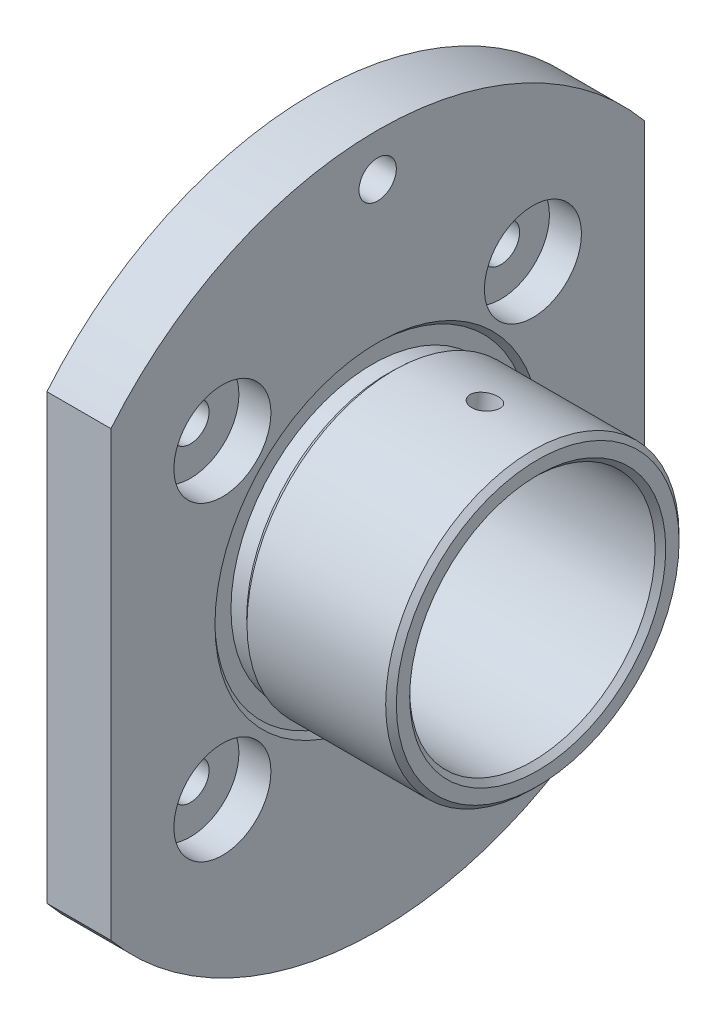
ISO-10303-21;
HEADER;
FILE_DESCRIPTION(('STEP AP214'),'2;1');
FILE_NAME('part.step','',(''),(''),'','','');
FILE_SCHEMA(('AUTOMOTIVE_DESIGN { 1 0 10303 214 1 1 1 1 }'));
ENDSEC;
DATA;
#1=APPLICATION_CONTEXT('core data for automotive mechanical design processes');
#2=APPLICATION_PROTOCOL_DEFINITION('international standard','automotive_design',2000,#1);
#3=PRODUCT_CONTEXT('',#1,'mechanical');
#4=PRODUCT('Part','Part','',(#3));
#5=PRODUCT_RELATED_PRODUCT_CATEGORY('part','',(#4));
#6=PRODUCT_DEFINITION_FORMATION('','',#4);
#7=PRODUCT_DEFINITION_CONTEXT('part definition',#1,'design');
#8=PRODUCT_DEFINITION('design','',#6,#7);
#9=PRODUCT_DEFINITION_SHAPE('','',#8);
#10=(LENGTH_UNIT() NAMED_UNIT(*) SI_UNIT(.MILLI.,.METRE.));
#11=(NAMED_UNIT(*) PLANE_ANGLE_UNIT() SI_UNIT($,.RADIAN.));
#12=(NAMED_UNIT(*) SI_UNIT($,.STERADIAN.) SOLID_ANGLE_UNIT());
#13=UNCERTAINTY_MEASURE_WITH_UNIT(LENGTH_MEASURE(1.E-05),#10,'distance_accuracy_value','');
#14=(GEOMETRIC_REPRESENTATION_CONTEXT(3) GLOBAL_UNCERTAINTY_ASSIGNED_CONTEXT((#13)) GLOBAL_UNIT_ASSIGNED_CONTEXT((#10,
#11,#12)) REPRESENTATION_CONTEXT('',''));
#15=CARTESIAN_POINT('',(0.,0.,0.));
#16=DIRECTION('',(0.,0.,1.));
#17=DIRECTION('',(1.,0.,0.));
#18=AXIS2_PLACEMENT_3D('',#15,#16,#17);
#19=CARTESIAN_POINT('',(-67.2248501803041,0.,0.));
#20=DIRECTION('',(-1.,0.,0.));
#21=DIRECTION('',(0.,0.,1.));
#22=AXIS2_PLACEMENT_3D('',#19,#20,#21);
#23=CYLINDRICAL_SURFACE('',#22,65.);
#24=CARTESIAN_POINT('',(-39.7519478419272,0.,0.));
#25=DIRECTION('',(-1.,0.,0.));
#26=DIRECTION('',(0.,0.,1.));
#27=AXIS2_PLACEMENT_3D('',#24,#25,#26);
#28=CIRCLE('',#27,65.);
#29=CARTESIAN_POINT('',(-39.7519478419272,41.5331193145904,50.));
#30=VERTEX_POINT('',#29);
#31=CARTESIAN_POINT('',(-39.7519478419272,41.5331193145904,-50.));
#32=VERTEX_POINT('',#31);
#33=EDGE_CURVE('E83',#30,#32,#28,.T.);
#34=ORIENTED_EDGE('',*,*,#33,.T.);
#35=DIRECTION('',(-1.,0.,0.));
#36=VECTOR('',#35,1.);
#37=CARTESIAN_POINT('',(-67.2248501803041,41.5331193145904,-50.));
#38=LINE('',#37,#36);
#39=CARTESIAN_POINT('',(-51.7519478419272,41.5331193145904,-50.));
#40=VERTEX_POINT('',#39);
#41=EDGE_CURVE('E73',#32,#40,#38,.T.);
#42=ORIENTED_EDGE('',*,*,#41,.T.);
#43=CARTESIAN_POINT('',(-51.7519478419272,0.,0.));
#44=DIRECTION('',(-1.,0.,0.));
#45=DIRECTION('',(0.,0.,1.));
#46=AXIS2_PLACEMENT_3D('',#43,#44,#45);
#47=CIRCLE('',#46,65.);
#48=CARTESIAN_POINT('',(-51.7519478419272,41.5331193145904,50.));
#49=VERTEX_POINT('',#48);
#50=EDGE_CURVE('E81',#49,#40,#47,.T.);
#51=ORIENTED_EDGE('',*,*,#50,.F.);
#52=DIRECTION('',(-1.,0.,0.));
#53=VECTOR('',#52,1.);
#54=CARTESIAN_POINT('',(-67.2248501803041,41.5331193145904,50.));
#55=LINE('',#54,#53);
#56=EDGE_CURVE('E55',#49,#30,#55,.F.);
#57=ORIENTED_EDGE('',*,*,#56,.T.);
#58=EDGE_LOOP('',(#34,#42,#51,#57));
#59=FACE_BOUND('',#58,.T.);
#60=ADVANCED_FACE('F33',(#59),#23,.T.);
#61=CARTESIAN_POINT('',(-59.7519478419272,-29.1036255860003,29.1036255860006));
#62=DIRECTION('',(1.,0.,0.));
#63=DIRECTION('',(0.,0.,-1.));
#64=AXIS2_PLACEMENT_3D('',#61,#62,#63);
#65=CYLINDRICAL_SURFACE('',#64,3.49999999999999);
#66=CARTESIAN_POINT('',(-51.7519478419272,-29.1036255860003,29.1036255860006));
#67=DIRECTION('',(1.,0.,0.));
#68=DIRECTION('',(0.,0.,-1.));
#69=AXIS2_PLACEMENT_3D('',#66,#67,#68);
#70=CIRCLE('',#69,3.49999999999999);
#71=CARTESIAN_POINT('',(-51.7519478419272,-29.1036255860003,25.6036255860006));
#72=VERTEX_POINT('',#71);
#73=EDGE_CURVE('E234',#72,#72,#70,.T.);
#74=ORIENTED_EDGE('',*,*,#73,.F.);
#75=EDGE_LOOP('',(#74));
#76=FACE_BOUND('',#75,.T.);
#77=CARTESIAN_POINT('',(-45.7519478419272,-29.1036255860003,29.1036255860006));
#78=DIRECTION('',(1.,0.,0.));
#79=DIRECTION('',(0.,0.,-1.));
#80=AXIS2_PLACEMENT_3D('',#77,#78,#79);
#81=CIRCLE('',#80,3.49999999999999);
#82=CARTESIAN_POINT('',(-45.7519478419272,-29.1036255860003,25.6036255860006));
#83=VERTEX_POINT('',#82);
#84=EDGE_CURVE('E216',#83,#83,#81,.F.);
#85=ORIENTED_EDGE('',*,*,#84,.F.);
#86=EDGE_LOOP('',(#85));
#87=FACE_BOUND('',#86,.T.);
#88=ADVANCED_FACE('F190',(#76,#87),#65,.F.);
#89=CARTESIAN_POINT('',(-59.7519478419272,-29.1036255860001,-29.1036255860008));
#90=DIRECTION('',(1.,0.,0.));
#91=DIRECTION('',(0.,0.,-1.));
#92=AXIS2_PLACEMENT_3D('',#89,#90,#91);
#93=CYLINDRICAL_SURFACE('',#92,3.5);
#94=CARTESIAN_POINT('',(-51.7519478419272,-29.1036255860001,-29.1036255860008));
#95=DIRECTION('',(1.,0.,0.));
#96=DIRECTION('',(0.,0.,-1.));
#97=AXIS2_PLACEMENT_3D('',#94,#95,#96);
#98=CIRCLE('',#97,3.5);
#99=CARTESIAN_POINT('',(-51.7519478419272,-29.1036255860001,-32.6036255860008));
#100=VERTEX_POINT('',#99);
#101=EDGE_CURVE('E238',#100,#100,#98,.T.);
#102=ORIENTED_EDGE('',*,*,#101,.F.);
#103=EDGE_LOOP('',(#102));
#104=FACE_BOUND('',#103,.T.);
#105=CARTESIAN_POINT('',(-45.7519478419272,-29.1036255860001,-29.1036255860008));
#106=DIRECTION('',(1.,0.,0.));
#107=DIRECTION('',(0.,0.,-1.));
#108=AXIS2_PLACEMENT_3D('',#105,#106,#107);
#109=CIRCLE('',#108,3.5);
#110=CARTESIAN_POINT('',(-45.7519478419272,-29.1036255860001,-32.6036255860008));
#111=VERTEX_POINT('',#110);
#112=EDGE_CURVE('E221',#111,#111,#109,.F.);
#113=ORIENTED_EDGE('',*,*,#112,.F.);
#114=EDGE_LOOP('',(#113));
#115=FACE_BOUND('',#114,.T.);
#116=ADVANCED_FACE('F195',(#104,#115),#93,.F.);
#117=CARTESIAN_POINT('',(-59.7519478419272,29.1036255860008,-29.1036255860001));
#118=DIRECTION('',(1.,0.,0.));
#119=DIRECTION('',(0.,0.,-1.));
#120=AXIS2_PLACEMENT_3D('',#117,#118,#119);
#121=CYLINDRICAL_SURFACE('',#120,3.5);
#122=CARTESIAN_POINT('',(-51.7519478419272,29.1036255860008,-29.1036255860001));
#123=DIRECTION('',(1.,0.,0.));
#124=DIRECTION('',(0.,0.,-1.));
#125=AXIS2_PLACEMENT_3D('',#122,#123,#124);
#126=CIRCLE('',#125,3.5);
#127=CARTESIAN_POINT('',(-51.7519478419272,29.1036255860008,-32.6036255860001));
#128=VERTEX_POINT('',#127);
#129=EDGE_CURVE('E241',#128,#128,#126,.T.);
#130=ORIENTED_EDGE('',*,*,#129,.F.);
#131=EDGE_LOOP('',(#130));
#132=FACE_BOUND('',#131,.T.);
#133=CARTESIAN_POINT('',(-45.7519478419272,29.1036255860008,-29.1036255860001));
#134=DIRECTION('',(1.,0.,0.));
#135=DIRECTION('',(0.,0.,-1.));
#136=AXIS2_PLACEMENT_3D('',#133,#134,#135);
#137=CIRCLE('',#136,3.5);
#138=CARTESIAN_POINT('',(-45.7519478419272,29.1036255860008,-32.6036255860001));
#139=VERTEX_POINT('',#138);
#140=EDGE_CURVE('E226',#139,#139,#137,.F.);
#141=ORIENTED_EDGE('',*,*,#140,.F.);
#142=EDGE_LOOP('',(#141));
#143=FACE_BOUND('',#142,.T.);
#144=ADVANCED_FACE('F277',(#132,#143),#121,.F.);
#145=CARTESIAN_POINT('',(-59.7519478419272,29.1036255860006,29.1036255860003));
#146=DIRECTION('',(1.,0.,0.));
#147=DIRECTION('',(0.,0.,-1.));
#148=AXIS2_PLACEMENT_3D('',#145,#146,#147);
#149=CYLINDRICAL_SURFACE('',#148,3.5);
#150=CARTESIAN_POINT('',(-51.7519478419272,29.1036255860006,29.1036255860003));
#151=DIRECTION('',(1.,0.,0.));
#152=DIRECTION('',(0.,0.,-1.));
#153=AXIS2_PLACEMENT_3D('',#150,#151,#152);
#154=CIRCLE('',#153,3.5);
#155=CARTESIAN_POINT('',(-51.7519478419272,29.1036255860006,25.6036255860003));
#156=VERTEX_POINT('',#155);
#157=EDGE_CURVE('E243',#156,#156,#154,.T.);
#158=ORIENTED_EDGE('',*,*,#157,.F.);
#159=EDGE_LOOP('',(#158));
#160=FACE_BOUND('',#159,.T.);
#161=CARTESIAN_POINT('',(-45.7519478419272,29.1036255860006,29.1036255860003));
#162=DIRECTION('',(1.,0.,0.));
#163=DIRECTION('',(0.,0.,-1.));
#164=AXIS2_PLACEMENT_3D('',#161,#162,#163);
#165=CIRCLE('',#164,3.5);
#166=CARTESIAN_POINT('',(-45.7519478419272,29.1036255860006,25.6036255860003));
#167=VERTEX_POINT('',#166);
#168=EDGE_CURVE('E231',#167,#167,#165,.F.);
#169=ORIENTED_EDGE('',*,*,#168,.F.);
#170=EDGE_LOOP('',(#169));
#171=FACE_BOUND('',#170,.T.);
#172=ADVANCED_FACE('F175',(#160,#171),#149,.F.);
#173=CARTESIAN_POINT('',(-67.2248501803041,0.,0.));
#174=DIRECTION('',(-1.,0.,0.));
#175=DIRECTION('',(0.,0.,1.));
#176=AXIS2_PLACEMENT_3D('',#173,#174,#175);
#177=CYLINDRICAL_SURFACE('',#176,35.);
#178=CARTESIAN_POINT('',(-54.7519478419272,0.,0.));
#179=DIRECTION('',(-1.,0.,0.));
#180=DIRECTION('',(0.,0.,1.));
#181=AXIS2_PLACEMENT_3D('',#178,#179,#180);
#182=CIRCLE('',#181,35.);
#183=CARTESIAN_POINT('',(-54.7519478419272,0.,35.));
#184=VERTEX_POINT('',#183);
#185=EDGE_CURVE('E110',#184,#184,#182,.T.);
#186=ORIENTED_EDGE('',*,*,#185,.F.);
#187=EDGE_LOOP('',(#186));
#188=FACE_BOUND('',#187,.T.);
#189=CARTESIAN_POINT('',(-51.7519478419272,0.,0.));
#190=DIRECTION('',(-1.,0.,0.));
#191=DIRECTION('',(0.,0.,1.));
#192=AXIS2_PLACEMENT_3D('',#189,#190,#191);
#193=CIRCLE('',#192,35.);
#194=CARTESIAN_POINT('',(-51.7519478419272,0.,35.));
#195=VERTEX_POINT('',#194);
#196=EDGE_CURVE('E91',#195,#195,#193,.T.);
#197=ORIENTED_EDGE('',*,*,#196,.T.);
#198=EDGE_LOOP('',(#197));
#199=FACE_BOUND('',#198,.T.);
#200=ADVANCED_FACE('F171',(#188,#199),#177,.T.);
#201=CARTESIAN_POINT('',(-54.7519478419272,23.,0.));
#202=DIRECTION('',(1.,0.,0.));
#203=DIRECTION('',(0.,0.,-1.));
#204=AXIS2_PLACEMENT_3D('',#201,#202,#203);
#205=PLANE('',#204);
#206=CARTESIAN_POINT('',(-54.7519478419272,0.,0.));
#207=DIRECTION('',(1.,0.,0.));
#208=DIRECTION('',(0.,0.,-1.));
#209=AXIS2_PLACEMENT_3D('',#206,#207,#208);
#210=CIRCLE('',#209,24.);
#211=CARTESIAN_POINT('',(-54.7519478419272,0.,-24.));
#212=VERTEX_POINT('',#211);
#213=EDGE_CURVE('E119',#212,#212,#210,.T.);
#214=ORIENTED_EDGE('',*,*,#213,.T.);
#215=EDGE_LOOP('',(#214));
#216=FACE_BOUND('',#215,.T.);
#217=ORIENTED_EDGE('',*,*,#185,.T.);
#218=EDGE_LOOP('',(#217));
#219=FACE_BOUND('',#218,.T.);
#220=ADVANCED_FACE('F167',(#216,#219),#205,.F.);
#221=CARTESIAN_POINT('',(-67.2248501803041,0.,0.));
#222=DIRECTION('',(-1.,0.,0.));
#223=DIRECTION('',(0.,0.,1.));
#224=AXIS2_PLACEMENT_3D('',#221,#222,#223);
#225=CYLINDRICAL_SURFACE('',#224,23.);
#226=CARTESIAN_POINT('',(-23.4046931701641,22.9904768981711,-0.661794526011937));
#227=CARTESIAN_POINT('',(-23.2647128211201,22.9904778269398,-0.661800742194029));
#228=CARTESIAN_POINT('',(-23.1246415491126,22.990144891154,-0.673657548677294));
#229=CARTESIAN_POINT('',(-22.8483872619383,22.9887154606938,-0.720760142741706));
#230=CARTESIAN_POINT('',(-22.7122086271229,22.9876181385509,-0.756031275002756));
#231=CARTESIAN_POINT('',(-22.4477799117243,22.9843763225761,-0.848875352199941));
#232=CARTESIAN_POINT('',(-22.3195248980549,22.9822324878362,-0.906434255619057));
#233=CARTESIAN_POINT('',(-22.0744801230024,22.9764785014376,-1.04212526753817));
#234=CARTESIAN_POINT('',(-21.9576881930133,22.9728686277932,-1.12025347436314));
#235=CARTESIAN_POINT('',(-21.7383598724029,22.9636731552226,-1.29514068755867));
#236=CARTESIAN_POINT('',(-21.6358793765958,22.9580800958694,-1.39196940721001));
#237=CARTESIAN_POINT('',(-21.4485648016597,22.9444310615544,-1.60126787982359));
#238=CARTESIAN_POINT('',(-21.3637315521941,22.9363749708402,-1.71373836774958));
#239=CARTESIAN_POINT('',(-21.2139236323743,22.9173801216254,-1.9513869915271));
#240=CARTESIAN_POINT('',(-21.1489988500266,22.9064342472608,-2.07659602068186));
#241=CARTESIAN_POINT('',(-21.0411701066,22.8814474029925,-2.33587426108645));
#242=CARTESIAN_POINT('',(-20.9982655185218,22.867406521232,-2.4699432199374));
#243=CARTESIAN_POINT('',(-20.9358601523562,22.8363158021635,-2.74251936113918));
#244=CARTESIAN_POINT('',(-20.9162671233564,22.8192781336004,-2.88100680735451));
#245=CARTESIAN_POINT('',(-20.9007554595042,22.7824659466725,-3.15893829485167));
#246=CARTESIAN_POINT('',(-20.9048361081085,22.7626915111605,-3.29838230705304));
#247=CARTESIAN_POINT('',(-20.9364813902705,22.7210980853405,-3.57365408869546));
#248=CARTESIAN_POINT('',(-20.9639468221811,22.6992880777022,-3.70949463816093));
#249=CARTESIAN_POINT('',(-21.0414273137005,22.6544139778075,-3.97436571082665));
#250=CARTESIAN_POINT('',(-21.0914427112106,22.6313498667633,-4.10339613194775));
#251=CARTESIAN_POINT('',(-21.2127110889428,22.584988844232,-4.35134890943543));
#252=CARTESIAN_POINT('',(-21.2840076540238,22.5616915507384,-4.47024987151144));
#253=CARTESIAN_POINT('',(-21.4457828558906,22.5161174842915,-4.69441774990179));
#254=CARTESIAN_POINT('',(-21.5362621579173,22.4938407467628,-4.79968419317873));
#255=CARTESIAN_POINT('',(-21.7343916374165,22.4514461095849,-4.99425219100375));
#256=CARTESIAN_POINT('',(-21.8421281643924,22.4313399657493,-5.08346839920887));
#257=CARTESIAN_POINT('',(-22.071415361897,22.3946283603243,-5.24283605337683));
#258=CARTESIAN_POINT('',(-22.1929660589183,22.3780229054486,-5.31298746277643));
#259=CARTESIAN_POINT('',(-22.4465008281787,22.349356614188,-5.43231482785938));
#260=CARTESIAN_POINT('',(-22.5784877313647,22.3372970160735,-5.48148506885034));
#261=CARTESIAN_POINT('',(-22.8491132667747,22.3185201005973,-5.55744593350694));
#262=CARTESIAN_POINT('',(-22.9877516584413,22.3118025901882,-5.58423736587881));
#263=CARTESIAN_POINT('',(-23.266986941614,22.3041800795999,-5.61460589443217));
#264=CARTESIAN_POINT('',(-23.4075702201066,22.3032455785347,-5.6183008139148));
#265=CARTESIAN_POINT('',(-23.687369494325,22.3071730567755,-5.60268618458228));
#266=CARTESIAN_POINT('',(-23.826585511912,22.3120349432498,-5.58337700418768));
#267=CARTESIAN_POINT('',(-24.0993432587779,22.3272107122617,-5.52237589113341));
#268=CARTESIAN_POINT('',(-24.2328983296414,22.3375109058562,-5.48074015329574));
#269=CARTESIAN_POINT('',(-24.4909586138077,22.3628834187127,-5.37627358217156));
#270=CARTESIAN_POINT('',(-24.6154635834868,22.3779558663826,-5.31344217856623));
#271=CARTESIAN_POINT('',(-24.85243853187,22.4119910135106,-5.16800134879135));
#272=CARTESIAN_POINT('',(-24.9648581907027,22.4309690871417,-5.08531353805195));
#273=CARTESIAN_POINT('',(-25.1739600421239,22.4716249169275,-4.90253166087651));
#274=CARTESIAN_POINT('',(-25.270641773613,22.4933027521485,-4.802437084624));
#275=CARTESIAN_POINT('',(-25.4459422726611,22.5382083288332,-4.5870788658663));
#276=CARTESIAN_POINT('',(-25.5244820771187,22.5614422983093,-4.47175222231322));
#277=CARTESIAN_POINT('',(-25.6607249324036,22.60812204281,-4.22942340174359));
#278=CARTESIAN_POINT('',(-25.718428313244,22.631567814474,-4.10242140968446));
#279=CARTESIAN_POINT('',(-25.8112276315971,22.6774737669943,-3.84054724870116));
#280=CARTESIAN_POINT('',(-25.8463705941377,22.6999359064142,-3.70569209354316));
#281=CARTESIAN_POINT('',(-25.8932048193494,22.7429727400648,-3.43167813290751));
#282=CARTESIAN_POINT('',(-25.9048968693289,22.7635474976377,-3.29251947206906));
#283=CARTESIAN_POINT('',(-25.9044851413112,22.8020122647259,-3.01460063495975));
#284=CARTESIAN_POINT('',(-25.8925036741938,22.8199155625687,-2.87584210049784));
#285=CARTESIAN_POINT('',(-25.8453423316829,22.8527634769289,-2.60196670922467));
#286=CARTESIAN_POINT('',(-25.8101624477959,22.867708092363,-2.46684985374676));
#287=CARTESIAN_POINT('',(-25.7176382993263,22.8945234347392,-2.20414208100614));
#288=CARTESIAN_POINT('',(-25.6602983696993,22.9063947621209,-2.0765496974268));
#289=CARTESIAN_POINT('',(-25.5250946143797,22.9272109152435,-1.83248990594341));
#290=CARTESIAN_POINT('',(-25.447230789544,22.9361557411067,-1.7160224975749));
#291=CARTESIAN_POINT('',(-25.2727324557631,22.9514967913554,-1.49697385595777));
#292=CARTESIAN_POINT('',(-25.1760068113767,22.9578801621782,-1.39446432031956));
#293=CARTESIAN_POINT('',(-24.966714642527,22.9685027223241,-1.20694974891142));
#294=CARTESIAN_POINT('',(-24.8541443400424,22.9727413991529,-1.12194889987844));
#295=CARTESIAN_POINT('',(-24.6159868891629,22.9795865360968,-0.971745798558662));
#296=CARTESIAN_POINT('',(-24.4903622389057,22.9821881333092,-0.90660282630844));
#297=CARTESIAN_POINT('',(-24.2300085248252,22.9862003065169,-0.798467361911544));
#298=CARTESIAN_POINT('',(-24.0952898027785,22.9876122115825,-0.755450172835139));
#299=CARTESIAN_POINT('',(-23.8673060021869,22.9892493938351,-0.703431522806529));
#300=CARTESIAN_POINT('',(-23.7754926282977,22.9897147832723,-0.687840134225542));
#301=CARTESIAN_POINT('',(-23.5906972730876,22.9903282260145,-0.667019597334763));
#302=CARTESIAN_POINT('',(-23.4977152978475,22.9904762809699,-0.661790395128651));
#303=CARTESIAN_POINT('',(-23.4046931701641,22.9904768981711,-0.661794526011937));
#304=B_SPLINE_CURVE_WITH_KNOTS('',3,(#226,#227,#228,#229,#230,#231,#232,#233,#234,#235,#236,
#237,#238,#239,#240,#241,#242,#243,#244,#245,#246,#247,#248,#249,#250,#251,#252,#253,#254,#255,
#256,#257,#258,#259,#260,#261,#262,#263,#264,#265,#266,#267,#268,#269,#270,#271,#272,#273,#274,
#275,#276,#277,#278,#279,#280,#281,#282,#283,#284,#285,#286,#287,#288,#289,#290,#291,#292,#293,
#294,#295,#296,#297,#298,#299,#300,#301,#302,#303),.UNSPECIFIED.,.T.,.F.,(4,2,2,2,2,2,2,2,2,2,2,
2,2,2,2,2,2,2,2,2,2,2,2,2,2,2,2,2,2,2,2,2,2,2,2,2,2,2,4),(0.,0.419601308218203,
0.839657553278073,1.25944958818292,1.67916205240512,2.10047045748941,2.5217986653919,
2.9441741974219,3.36653770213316,3.78722416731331,4.20789789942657,4.6267959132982,
5.04570020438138,5.46546838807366,5.88525113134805,6.30720400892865,6.72915769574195,
7.15122623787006,7.57327952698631,7.99317800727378,8.41306976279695,8.83190959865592,
9.2507607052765,9.67129325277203,10.0918381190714,10.5141803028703,10.9365157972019,
11.3579680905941,11.7794062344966,12.1986726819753,12.6179392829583,13.0371239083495,
13.4563085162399,13.8775710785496,14.2989342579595,14.7215432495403,15.143679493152,
15.4225215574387,15.7013621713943),.UNSPECIFIED.);
#305=CARTESIAN_POINT('',(-23.4046931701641,22.9904768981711,-0.661794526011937));
#306=VERTEX_POINT('',#305);
#307=EDGE_CURVE('E154',#306,#306,#304,.T.);
#308=ORIENTED_EDGE('',*,*,#307,.T.);
#309=EDGE_LOOP('',(#308));
#310=FACE_BOUND('',#309,.T.);
#311=CARTESIAN_POINT('',(-53.7519478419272,0.,0.));
#312=DIRECTION('',(1.,0.,0.));
#313=DIRECTION('',(0.,0.,-1.));
#314=AXIS2_PLACEMENT_3D('',#311,#312,#313);
#315=CIRCLE('',#314,23.);
#316=CARTESIAN_POINT('',(-53.7519478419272,0.,-23.));
#317=VERTEX_POINT('',#316);
#318=EDGE_CURVE('E116',#317,#317,#315,.F.);
#319=ORIENTED_EDGE('',*,*,#318,.T.);
#320=EDGE_LOOP('',(#319));
#321=FACE_BOUND('',#320,.T.);
#322=CARTESIAN_POINT('',(-10.7519478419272,0.,0.));
#323=DIRECTION('',(-1.,0.,0.));
#324=DIRECTION('',(0.,0.,1.));
#325=AXIS2_PLACEMENT_3D('',#322,#323,#324);
#326=CIRCLE('',#325,23.);
#327=CARTESIAN_POINT('',(-10.7519478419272,0.,23.));
#328=VERTEX_POINT('',#327);
#329=EDGE_CURVE('E113',#328,#328,#326,.F.);
#330=ORIENTED_EDGE('',*,*,#329,.T.);
#331=EDGE_LOOP('',(#330));
#332=FACE_BOUND('',#331,.T.);
#333=ADVANCED_FACE('F162',(#310,#321,#332),#225,.F.);
#334=CARTESIAN_POINT('',(-9.75194784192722,27.5,0.));
#335=DIRECTION('',(-1.,0.,0.));
#336=DIRECTION('',(0.,0.,1.));
#337=AXIS2_PLACEMENT_3D('',#334,#335,#336);
#338=PLANE('',#337);
#339=CARTESIAN_POINT('',(-9.75194784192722,0.,0.));
#340=DIRECTION('',(-1.,0.,0.));
#341=DIRECTION('',(0.,0.,1.));
#342=AXIS2_PLACEMENT_3D('',#339,#340,#341);
#343=CIRCLE('',#342,24.);
#344=CARTESIAN_POINT('',(-9.75194784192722,0.,24.));
#345=VERTEX_POINT('',#344);
#346=EDGE_CURVE('E125',#345,#345,#343,.T.);
#347=ORIENTED_EDGE('',*,*,#346,.T.);
#348=EDGE_LOOP('',(#347));
#349=FACE_BOUND('',#348,.T.);
#350=CARTESIAN_POINT('',(-9.75194784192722,0.,0.));
#351=DIRECTION('',(-1.,0.,0.));
#352=DIRECTION('',(0.,0.,1.));
#353=AXIS2_PLACEMENT_3D('',#350,#351,#352);
#354=CIRCLE('',#353,26.5);
#355=CARTESIAN_POINT('',(-9.75194784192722,0.,26.5));
#356=VERTEX_POINT('',#355);
#357=EDGE_CURVE('E122',#356,#356,#354,.F.);
#358=ORIENTED_EDGE('',*,*,#357,.T.);
#359=EDGE_LOOP('',(#358));
#360=FACE_BOUND('',#359,.T.);
#361=ADVANCED_FACE('F166',(#349,#360),#338,.F.);
#362=CARTESIAN_POINT('',(-67.2248501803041,0.,0.));
#363=DIRECTION('',(-1.,0.,0.));
#364=DIRECTION('',(0.,0.,1.));
#365=AXIS2_PLACEMENT_3D('',#362,#363,#364);
#366=CYLINDRICAL_SURFACE('',#365,27.5);
#367=CARTESIAN_POINT('',(-23.4046931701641,27.4700776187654,-1.28251144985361));
#368=CARTESIAN_POINT('',(-23.5448076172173,27.4700782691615,-1.28251769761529));
#369=CARTESIAN_POINT('',(-23.685016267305,27.4695320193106,-1.29436765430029));
#370=CARTESIAN_POINT('',(-23.9615507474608,27.4672722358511,-1.34145069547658));
#371=CARTESIAN_POINT('',(-24.0978720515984,27.4655573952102,-1.37670996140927));
#372=CARTESIAN_POINT('',(-24.3625868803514,27.4607463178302,-1.4695437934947));
#373=CARTESIAN_POINT('',(-24.4909849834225,27.4576508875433,-1.52710532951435));
#374=CARTESIAN_POINT('',(-24.7362878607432,27.4497649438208,-1.66282989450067));
#375=CARTESIAN_POINT('',(-24.8531950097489,27.4449747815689,-1.74098865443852));
#376=CARTESIAN_POINT('',(-25.072580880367,27.4333210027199,-1.91587499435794));
#377=CARTESIAN_POINT('',(-25.1750199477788,27.4264518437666,-2.01265195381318));
#378=CARTESIAN_POINT('',(-25.3622207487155,27.4102970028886,-2.22184635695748));
#379=CARTESIAN_POINT('',(-25.4469816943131,27.4010112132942,-2.33426449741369));
#380=CARTESIAN_POINT('',(-25.596554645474,27.3797458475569,-2.57171713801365));
#381=CARTESIAN_POINT('',(-25.6613319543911,27.3677616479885,-2.6967730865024));
#382=CARTESIAN_POINT('',(-25.7688769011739,27.3410047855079,-2.95573744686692));
#383=CARTESIAN_POINT('',(-25.8116449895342,27.3262321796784,-3.08964567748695));
#384=CARTESIAN_POINT('',(-25.8738422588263,27.2940506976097,-3.36207491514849));
#385=CARTESIAN_POINT('',(-25.8933360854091,27.2766492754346,-3.50058204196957));
#386=CARTESIAN_POINT('',(-25.9086313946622,27.2395288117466,-3.77858870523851));
#387=CARTESIAN_POINT('',(-25.9044333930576,27.2198098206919,-3.91808822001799));
#388=CARTESIAN_POINT('',(-25.8725169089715,27.1787108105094,-4.19369045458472));
#389=CARTESIAN_POINT('',(-25.8448679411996,27.1573358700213,-4.32980199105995));
#390=CARTESIAN_POINT('',(-25.7669425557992,27.1136853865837,-4.59523312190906));
#391=CARTESIAN_POINT('',(-25.7166658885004,27.0914098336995,-4.72455264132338));
#392=CARTESIAN_POINT('',(-25.5948353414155,27.046908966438,-4.97299537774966));
#393=CARTESIAN_POINT('',(-25.5232504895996,27.0246837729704,-5.09210342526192));
#394=CARTESIAN_POINT('',(-25.3608580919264,26.9814081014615,-5.31664484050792));
#395=CARTESIAN_POINT('',(-25.2700500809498,26.9603576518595,-5.42207787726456));
#396=CARTESIAN_POINT('',(-25.0713976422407,26.9204766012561,-5.61674907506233));
#397=CARTESIAN_POINT('',(-24.9634927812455,26.9016543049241,-5.70592727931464));
#398=CARTESIAN_POINT('',(-24.7339198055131,26.867385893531,-5.86517103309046));
#399=CARTESIAN_POINT('',(-24.6122516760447,26.8519397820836,-5.93523656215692));
#400=CARTESIAN_POINT('',(-24.3585616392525,26.8253391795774,-6.05433070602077));
#401=CARTESIAN_POINT('',(-24.2265380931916,26.8141853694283,-6.10335598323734));
#402=CARTESIAN_POINT('',(-23.9559063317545,26.7968596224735,-6.17898316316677));
#403=CARTESIAN_POINT('',(-23.817298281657,26.79068756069,-6.20558562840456));
#404=CARTESIAN_POINT('',(-23.537962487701,26.7837257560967,-6.23556535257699));
#405=CARTESIAN_POINT('',(-23.3972440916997,26.7829168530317,-6.23902529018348));
#406=CARTESIAN_POINT('',(-23.1172162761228,26.7866813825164,-6.22284234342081));
#407=CARTESIAN_POINT('',(-22.9779068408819,26.7912547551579,-6.20319971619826));
#408=CARTESIAN_POINT('',(-22.7048956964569,26.8054843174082,-6.1414169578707));
#409=CARTESIAN_POINT('',(-22.5711847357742,26.8151317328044,-6.09931566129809));
#410=CARTESIAN_POINT('',(-22.3128790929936,26.8389118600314,-5.99380660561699));
#411=CARTESIAN_POINT('',(-22.1882845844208,26.8530446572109,-5.93039844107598));
#412=CARTESIAN_POINT('',(-21.9513624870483,26.8849997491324,-5.78380589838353));
#413=CARTESIAN_POINT('',(-21.8390705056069,26.9028323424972,-5.70056621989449));
#414=CARTESIAN_POINT('',(-21.6303014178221,26.9411402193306,-5.51668026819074));
#415=CARTESIAN_POINT('',(-21.5338246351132,26.9616155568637,-5.41603363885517));
#416=CARTESIAN_POINT('',(-21.3591347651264,27.0041605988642,-5.19975666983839));
#417=CARTESIAN_POINT('',(-21.280976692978,27.0262348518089,-5.08408277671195));
#418=CARTESIAN_POINT('',(-21.1455208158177,27.0708002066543,-4.84117781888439));
#419=CARTESIAN_POINT('',(-21.0882227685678,27.0932913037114,-4.71394688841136));
#420=CARTESIAN_POINT('',(-20.9962073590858,27.1376164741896,-4.45167593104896));
#421=CARTESIAN_POINT('',(-20.9614563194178,27.1594514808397,-4.31664788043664));
#422=CARTESIAN_POINT('',(-20.9154113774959,27.2016185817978,-4.04242274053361));
#423=CARTESIAN_POINT('',(-20.9041169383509,27.2219507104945,-3.90322574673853));
#424=CARTESIAN_POINT('',(-20.9053126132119,27.2603742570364,-3.62513837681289));
#425=CARTESIAN_POINT('',(-20.9177171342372,27.2784734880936,-3.48624870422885));
#426=CARTESIAN_POINT('',(-20.9657796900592,27.3120965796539,-3.21223318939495));
#427=CARTESIAN_POINT('',(-21.00143775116,27.3276204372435,-3.07710735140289));
#428=CARTESIAN_POINT('',(-21.094972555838,27.3559154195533,-2.81448888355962));
#429=CARTESIAN_POINT('',(-21.1528473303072,27.368686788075,-2.68699557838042));
#430=CARTESIAN_POINT('',(-21.2891632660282,27.3915218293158,-2.44326291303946));
#431=CARTESIAN_POINT('',(-21.3676041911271,27.4015855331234,-2.32702342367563));
#432=CARTESIAN_POINT('',(-21.5431471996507,27.4192508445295,-2.10872895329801));
#433=CARTESIAN_POINT('',(-21.6403128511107,27.4268438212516,-2.0067243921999));
#434=CARTESIAN_POINT('',(-21.8504267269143,27.4398484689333,-1.82029496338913));
#435=CARTESIAN_POINT('',(-21.9633787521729,27.4452596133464,-1.73587434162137));
#436=CARTESIAN_POINT('',(-22.2021188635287,27.4542748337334,-1.58694337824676));
#437=CARTESIAN_POINT('',(-22.3279341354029,27.4578749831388,-1.5224764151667));
#438=CARTESIAN_POINT('',(-22.5885486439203,27.4635897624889,-1.41567101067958));
#439=CARTESIAN_POINT('',(-22.7233374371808,27.4657060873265,-1.37330733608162));
#440=CARTESIAN_POINT('',(-22.9498720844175,27.4681811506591,-1.32264815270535));
#441=CARTESIAN_POINT('',(-23.0401645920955,27.468895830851,-1.30761775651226));
#442=CARTESIAN_POINT('',(-23.2218557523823,27.4698438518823,-1.28754738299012));
#443=CARTESIAN_POINT('',(-23.3132544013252,27.4700771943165,-1.28250737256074));
#444=CARTESIAN_POINT('',(-23.4046931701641,27.4700776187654,-1.28251144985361));
#445=B_SPLINE_CURVE_WITH_KNOTS('',3,(#367,#368,#369,#370,#371,#372,#373,#374,#375,#376,#377,
#378,#379,#380,#381,#382,#383,#384,#385,#386,#387,#388,#389,#390,#391,#392,#393,#394,#395,#396,
#397,#398,#399,#400,#401,#402,#403,#404,#405,#406,#407,#408,#409,#410,#411,#412,#413,#414,#415,
#416,#417,#418,#419,#420,#421,#422,#423,#424,#425,#426,#427,#428,#429,#430,#431,#432,#433,#434,
#435,#436,#437,#438,#439,#440,#441,#442,#443,#444),.UNSPECIFIED.,.T.,.F.,(4,2,2,2,2,2,2,2,2,2,2,
2,2,2,2,2,2,2,2,2,2,2,2,2,2,2,2,2,2,2,2,2,2,2,2,2,2,2,4),(0.,0.420009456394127,0.84048945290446,
1.2607241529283,1.68087182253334,2.102149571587,2.52344609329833,2.94547002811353,
3.36748532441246,3.78832570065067,4.20915691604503,4.62874502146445,5.04833775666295,
5.46854338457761,5.88875918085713,6.31049491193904,6.73223109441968,7.15403415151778,
7.57582662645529,7.99611140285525,8.4163915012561,8.83594721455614,9.25551091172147,
9.6762585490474,10.0970147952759,10.5190189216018,10.941018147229,11.3623855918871,
11.7837433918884,12.2035822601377,12.6234216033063,13.0432237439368,13.4630210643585,
13.8842694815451,14.3056194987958,14.7278791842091,15.1496557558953,15.4237550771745,
15.6978534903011),.UNSPECIFIED.);
#446=CARTESIAN_POINT('',(-23.4046931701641,27.4700776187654,-1.28251144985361));
#447=VERTEX_POINT('',#446);
#448=EDGE_CURVE('E131',#447,#447,#445,.T.);
#449=ORIENTED_EDGE('',*,*,#448,.T.);
#450=EDGE_LOOP('',(#449));
#451=FACE_BOUND('',#450,.T.);
#452=CARTESIAN_POINT('',(-10.7519478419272,0.,0.));
#453=DIRECTION('',(-1.,0.,0.));
#454=DIRECTION('',(0.,0.,1.));
#455=AXIS2_PLACEMENT_3D('',#452,#453,#454);
#456=CIRCLE('',#455,27.5);
#457=CARTESIAN_POINT('',(-10.7519478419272,0.,27.5));
#458=VERTEX_POINT('',#457);
#459=EDGE_CURVE('E128',#458,#458,#456,.T.);
#460=ORIENTED_EDGE('',*,*,#459,.T.);
#461=EDGE_LOOP('',(#460));
#462=FACE_BOUND('',#461,.T.);
#463=CARTESIAN_POINT('',(-36.7519478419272,0.,0.));
#464=DIRECTION('',(-1.,0.,0.));
#465=DIRECTION('',(0.,0.,1.));
#466=AXIS2_PLACEMENT_3D('',#463,#464,#465);
#467=CIRCLE('',#466,27.5);
#468=CARTESIAN_POINT('',(-36.7519478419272,0.,27.5));
#469=VERTEX_POINT('',#468);
#470=EDGE_CURVE('E107',#469,#469,#467,.T.);
#471=ORIENTED_EDGE('',*,*,#470,.F.);
#472=EDGE_LOOP('',(#471));
#473=FACE_BOUND('',#472,.T.);
#474=ADVANCED_FACE('F140',(#451,#462,#473),#366,.T.);
#475=CARTESIAN_POINT('',(-36.7519478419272,0.,0.));
#476=DIRECTION('',(1.,0.,0.));
#477=DIRECTION('',(0.,0.,-1.));
#478=AXIS2_PLACEMENT_3D('',#475,#476,#477);
#479=CONICAL_SURFACE('',#478,27.5,0.759164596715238);
#480=CARTESIAN_POINT('',(-37.8058411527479,0.,0.));
#481=DIRECTION('',(-1.,0.,0.));
#482=DIRECTION('',(0.,0.,1.));
#483=AXIS2_PLACEMENT_3D('',#480,#481,#482);
#484=CIRCLE('',#483,26.5);
#485=CARTESIAN_POINT('',(-37.8058411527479,0.,26.5));
#486=VERTEX_POINT('',#485);
#487=EDGE_CURVE('E104',#486,#486,#484,.T.);
#488=ORIENTED_EDGE('',*,*,#487,.F.);
#489=EDGE_LOOP('',(#488));
#490=FACE_BOUND('',#489,.T.);
#491=ORIENTED_EDGE('',*,*,#470,.T.);
#492=EDGE_LOOP('',(#491));
#493=FACE_BOUND('',#492,.T.);
#494=ADVANCED_FACE('F317',(#490,#493),#479,.T.);
#495=CARTESIAN_POINT('',(-67.2248501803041,0.,0.));
#496=DIRECTION('',(-1.,0.,0.));
#497=DIRECTION('',(0.,0.,1.));
#498=AXIS2_PLACEMENT_3D('',#495,#496,#497);
#499=CYLINDRICAL_SURFACE('',#498,26.5);
#500=CARTESIAN_POINT('',(-40.7519478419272,0.,0.));
#501=DIRECTION('',(-1.,0.,0.));
#502=DIRECTION('',(0.,0.,1.));
#503=AXIS2_PLACEMENT_3D('',#500,#501,#502);
#504=CIRCLE('',#503,26.5);
#505=CARTESIAN_POINT('',(-40.7519478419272,0.,26.5));
#506=VERTEX_POINT('',#505);
#507=EDGE_CURVE('E101',#506,#506,#504,.T.);
#508=ORIENTED_EDGE('',*,*,#507,.F.);
#509=EDGE_LOOP('',(#508));
#510=FACE_BOUND('',#509,.T.);
#511=ORIENTED_EDGE('',*,*,#487,.T.);
#512=EDGE_LOOP('',(#511));
#513=FACE_BOUND('',#512,.T.);
#514=ADVANCED_FACE('F324',(#510,#513),#499,.T.);
#515=CARTESIAN_POINT('',(-40.7519478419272,26.5,0.));
#516=DIRECTION('',(-1.,0.,0.));
#517=DIRECTION('',(0.,0.,1.));
#518=AXIS2_PLACEMENT_3D('',#515,#516,#517);
#519=PLANE('',#518);
#520=CARTESIAN_POINT('',(-40.7519478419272,0.,0.));
#521=DIRECTION('',(-1.,0.,0.));
#522=DIRECTION('',(0.,0.,1.));
#523=AXIS2_PLACEMENT_3D('',#520,#521,#522);
#524=CIRCLE('',#523,29.5511373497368);
#525=CARTESIAN_POINT('',(-40.7519478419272,0.,29.5511373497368));
#526=VERTEX_POINT('',#525);
#527=EDGE_CURVE('E98',#526,#526,#524,.T.);
#528=ORIENTED_EDGE('',*,*,#527,.F.);
#529=EDGE_LOOP('',(#528));
#530=FACE_BOUND('',#529,.T.);
#531=ORIENTED_EDGE('',*,*,#507,.T.);
#532=EDGE_LOOP('',(#531));
#533=FACE_BOUND('',#532,.T.);
#534=ADVANCED_FACE('F331',(#530,#533),#519,.F.);
#535=CARTESIAN_POINT('',(-40.7519478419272,0.,0.));
#536=DIRECTION('',(1.,0.,0.));
#537=DIRECTION('',(0.,0.,-1.));
#538=AXIS2_PLACEMENT_3D('',#535,#536,#537);
#539=CONICAL_SURFACE('',#538,29.5511373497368,0.759164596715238);
#540=CARTESIAN_POINT('',(-39.7519478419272,0.,0.));
#541=DIRECTION('',(-1.,0.,0.));
#542=DIRECTION('',(0.,0.,1.));
#543=AXIS2_PLACEMENT_3D('',#540,#541,#542);
#544=CIRCLE('',#543,30.5);
#545=CARTESIAN_POINT('',(-39.7519478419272,0.,30.5));
#546=VERTEX_POINT('',#545);
#547=EDGE_CURVE('E95',#546,#546,#544,.T.);
#548=ORIENTED_EDGE('',*,*,#547,.F.);
#549=EDGE_LOOP('',(#548));
#550=FACE_BOUND('',#549,.T.);
#551=ORIENTED_EDGE('',*,*,#527,.T.);
#552=EDGE_LOOP('',(#551));
#553=FACE_BOUND('',#552,.T.);
#554=ADVANCED_FACE('F207',(#550,#553),#539,.F.);
#555=CARTESIAN_POINT('',(-39.7519478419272,65.,0.));
#556=DIRECTION('',(-1.,0.,0.));
#557=DIRECTION('',(0.,0.,1.));
#558=AXIS2_PLACEMENT_3D('',#555,#556,#557);
#559=PLANE('',#558);
#560=CARTESIAN_POINT('',(-39.7519478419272,-29.1036255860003,29.1036255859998));
#561=DIRECTION('',(1.,0.,0.));
#562=DIRECTION('',(0.,0.,-1.));
#563=AXIS2_PLACEMENT_3D('',#560,#561,#562);
#564=CIRCLE('',#563,9.09308696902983);
#565=CARTESIAN_POINT('',(-39.7519478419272,-29.1036255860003,20.01053861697));
#566=VERTEX_POINT('',#565);
#567=EDGE_CURVE('E435',#566,#566,#564,.T.);
#568=ORIENTED_EDGE('',*,*,#567,.F.);
#569=EDGE_LOOP('',(#568));
#570=FACE_BOUND('',#569,.T.);
#571=CARTESIAN_POINT('',(-39.7519478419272,-29.1036255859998,-29.1036255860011));
#572=DIRECTION('',(1.,0.,0.));
#573=DIRECTION('',(0.,0.,-1.));
#574=AXIS2_PLACEMENT_3D('',#571,#572,#573);
#575=CIRCLE('',#574,9.09308696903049);
#576=CARTESIAN_POINT('',(-39.7519478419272,-29.1036255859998,-38.1967125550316));
#577=VERTEX_POINT('',#576);
#578=EDGE_CURVE('E219',#577,#577,#575,.T.);
#579=ORIENTED_EDGE('',*,*,#578,.F.);
#580=EDGE_LOOP('',(#579));
#581=FACE_BOUND('',#580,.T.);
#582=CARTESIAN_POINT('',(-39.7519478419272,29.1036255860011,-29.1036255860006));
#583=DIRECTION('',(1.,0.,0.));
#584=DIRECTION('',(0.,0.,-1.));
#585=AXIS2_PLACEMENT_3D('',#582,#583,#584);
#586=CIRCLE('',#585,9.09308696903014);
#587=CARTESIAN_POINT('',(-39.7519478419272,29.1036255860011,-38.1967125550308));
#588=VERTEX_POINT('',#587);
#589=EDGE_CURVE('E224',#588,#588,#586,.T.);
#590=ORIENTED_EDGE('',*,*,#589,.F.);
#591=EDGE_LOOP('',(#590));
#592=FACE_BOUND('',#591,.T.);
#593=CARTESIAN_POINT('',(-39.7519478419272,29.1036255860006,29.1036255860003));
#594=DIRECTION('',(1.,0.,0.));
#595=DIRECTION('',(0.,0.,-1.));
#596=AXIS2_PLACEMENT_3D('',#593,#594,#595);
#597=CIRCLE('',#596,9.09308696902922);
#598=CARTESIAN_POINT('',(-39.7519478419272,29.1036255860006,20.0105386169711));
#599=VERTEX_POINT('',#598);
#600=EDGE_CURVE('E229',#599,#599,#597,.T.);
#601=ORIENTED_EDGE('',*,*,#600,.F.);
#602=EDGE_LOOP('',(#601));
#603=FACE_BOUND('',#602,.T.);
#604=CARTESIAN_POINT('',(-39.7519478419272,57.,0.));
#605=DIRECTION('',(1.,0.,0.));
#606=DIRECTION('',(0.,0.,-1.));
#607=AXIS2_PLACEMENT_3D('',#604,#605,#606);
#608=CIRCLE('',#607,3.5);
#609=CARTESIAN_POINT('',(-39.7519478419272,57.,-3.5));
#610=VERTEX_POINT('',#609);
#611=EDGE_CURVE('E160',#610,#610,#608,.T.);
#612=ORIENTED_EDGE('',*,*,#611,.F.);
#613=EDGE_LOOP('',(#612));
#614=FACE_BOUND('',#613,.T.);
#615=CARTESIAN_POINT('',(-39.7519478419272,-41.5331193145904,-50.));
#616=VERTEX_POINT('',#615);
#617=CARTESIAN_POINT('',(-39.7519478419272,-41.5331193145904,50.));
#618=VERTEX_POINT('',#617);
#619=EDGE_CURVE('E87',#616,#618,#28,.T.);
#620=ORIENTED_EDGE('',*,*,#619,.F.);
#621=DIRECTION('',(0.,1.,0.));
#622=VECTOR('',#621,1.);
#623=CARTESIAN_POINT('',(-39.7519478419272,65.,-50.));
#624=LINE('',#623,#622);
#625=EDGE_CURVE('E84',#616,#32,#624,.T.);
#626=ORIENTED_EDGE('',*,*,#625,.T.);
#627=ORIENTED_EDGE('',*,*,#33,.F.);
#628=DIRECTION('',(0.,-1.,0.));
#629=VECTOR('',#628,1.);
#630=CARTESIAN_POINT('',(-39.7519478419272,65.,50.));
#631=LINE('',#630,#629);
#632=EDGE_CURVE('E434',#30,#618,#631,.T.);
#633=ORIENTED_EDGE('',*,*,#632,.T.);
#634=EDGE_LOOP('',(#620,#626,#627,#633));
#635=FACE_BOUND('',#634,.T.);
#636=ORIENTED_EDGE('',*,*,#547,.T.);
#637=EDGE_LOOP('',(#636));
#638=FACE_BOUND('',#637,.T.);
#639=ADVANCED_FACE('F200',(#570,#581,#592,#603,#614,#635,#638),#559,.F.);
#640=CARTESIAN_POINT('',(-51.7519478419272,-41.5331193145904,-50.));
#641=VERTEX_POINT('',#640);
#642=CARTESIAN_POINT('',(-51.7519478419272,-41.5331193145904,50.));
#643=VERTEX_POINT('',#642);
#644=EDGE_CURVE('E88',#641,#643,#47,.T.);
#645=ORIENTED_EDGE('',*,*,#644,.F.);
#646=DIRECTION('',(-1.,0.,0.));
#647=VECTOR('',#646,1.);
#648=CARTESIAN_POINT('',(-67.2248501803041,-41.5331193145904,-50.));
#649=LINE('',#648,#647);
#650=EDGE_CURVE('E48',#641,#616,#649,.F.);
#651=ORIENTED_EDGE('',*,*,#650,.T.);
#652=ORIENTED_EDGE('',*,*,#619,.T.);
#653=DIRECTION('',(-1.,0.,0.));
#654=VECTOR('',#653,1.);
#655=CARTESIAN_POINT('',(-67.2248501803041,-41.5331193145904,50.));
#656=LINE('',#655,#654);
#657=EDGE_CURVE('E212',#618,#643,#656,.T.);
#658=ORIENTED_EDGE('',*,*,#657,.T.);
#659=EDGE_LOOP('',(#645,#651,#652,#658));
#660=FACE_BOUND('',#659,.T.);
#661=ADVANCED_FACE('F191',(#660),#23,.T.);
#662=CARTESIAN_POINT('',(-51.7519478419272,35.,0.));
#663=DIRECTION('',(1.,0.,0.));
#664=DIRECTION('',(0.,0.,-1.));
#665=AXIS2_PLACEMENT_3D('',#662,#663,#664);
#666=PLANE('',#665);
#667=ORIENTED_EDGE('',*,*,#73,.T.);
#668=EDGE_LOOP('',(#667));
#669=FACE_BOUND('',#668,.T.);
#670=ORIENTED_EDGE('',*,*,#101,.T.);
#671=EDGE_LOOP('',(#670));
#672=FACE_BOUND('',#671,.T.);
#673=ORIENTED_EDGE('',*,*,#129,.T.);
#674=EDGE_LOOP('',(#673));
#675=FACE_BOUND('',#674,.T.);
#676=ORIENTED_EDGE('',*,*,#157,.T.);
#677=EDGE_LOOP('',(#676));
#678=FACE_BOUND('',#677,.T.);
#679=CARTESIAN_POINT('',(-51.7519478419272,57.,0.));
#680=DIRECTION('',(1.,0.,0.));
#681=DIRECTION('',(0.,0.,-1.));
#682=AXIS2_PLACEMENT_3D('',#679,#680,#681);
#683=CIRCLE('',#682,3.5);
#684=CARTESIAN_POINT('',(-51.7519478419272,57.,-3.5));
#685=VERTEX_POINT('',#684);
#686=EDGE_CURVE('E138',#685,#685,#683,.T.);
#687=ORIENTED_EDGE('',*,*,#686,.T.);
#688=EDGE_LOOP('',(#687));
#689=FACE_BOUND('',#688,.T.);
#690=ORIENTED_EDGE('',*,*,#196,.F.);
#691=EDGE_LOOP('',(#690));
#692=FACE_BOUND('',#691,.T.);
#693=ORIENTED_EDGE('',*,*,#50,.T.);
#694=DIRECTION('',(0.,-1.,0.));
#695=VECTOR('',#694,1.);
#696=CARTESIAN_POINT('',(-51.7519478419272,35.,-50.));
#697=LINE('',#696,#695);
#698=EDGE_CURVE('E11',#40,#641,#697,.T.);
#699=ORIENTED_EDGE('',*,*,#698,.T.);
#700=ORIENTED_EDGE('',*,*,#644,.T.);
#701=DIRECTION('',(0.,1.,0.));
#702=VECTOR('',#701,1.);
#703=CARTESIAN_POINT('',(-51.7519478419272,35.,50.));
#704=LINE('',#703,#702);
#705=EDGE_CURVE('E41',#643,#49,#704,.T.);
#706=ORIENTED_EDGE('',*,*,#705,.T.);
#707=EDGE_LOOP('',(#693,#699,#700,#706));
#708=FACE_BOUND('',#707,.T.);
#709=ADVANCED_FACE('F86',(#669,#672,#675,#678,#689,#692,#708),#666,.F.);
#710=CARTESIAN_POINT('',(-53.7519478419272,0.,0.));
#711=DIRECTION('',(-1.,0.,0.));
#712=DIRECTION('',(0.,0.,1.));
#713=AXIS2_PLACEMENT_3D('',#710,#711,#712);
#714=CONICAL_SURFACE('',#713,23.,0.785398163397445);
#715=ORIENTED_EDGE('',*,*,#213,.F.);
#716=EDGE_LOOP('',(#715));
#717=FACE_BOUND('',#716,.T.);
#718=ORIENTED_EDGE('',*,*,#318,.F.);
#719=EDGE_LOOP('',(#718));
#720=FACE_BOUND('',#719,.T.);
#721=ADVANCED_FACE('F177',(#717,#720),#714,.F.);
#722=CARTESIAN_POINT('',(-9.75194784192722,0.,0.));
#723=DIRECTION('',(1.,0.,0.));
#724=DIRECTION('',(0.,0.,-1.));
#725=AXIS2_PLACEMENT_3D('',#722,#723,#724);
#726=CONICAL_SURFACE('',#725,24.,0.785398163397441);
#727=ORIENTED_EDGE('',*,*,#329,.F.);
#728=EDGE_LOOP('',(#727));
#729=FACE_BOUND('',#728,.T.);
#730=ORIENTED_EDGE('',*,*,#346,.F.);
#731=EDGE_LOOP('',(#730));
#732=FACE_BOUND('',#731,.T.);
#733=ADVANCED_FACE('F179',(#729,#732),#726,.F.);
#734=CARTESIAN_POINT('',(-10.7519478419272,0.,0.));
#735=DIRECTION('',(-1.,0.,0.));
#736=DIRECTION('',(0.,0.,1.));
#737=AXIS2_PLACEMENT_3D('',#734,#735,#736);
#738=CONICAL_SURFACE('',#737,27.5,0.78539816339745);
#739=ORIENTED_EDGE('',*,*,#357,.F.);
#740=EDGE_LOOP('',(#739));
#741=FACE_BOUND('',#740,.T.);
#742=ORIENTED_EDGE('',*,*,#459,.F.);
#743=EDGE_LOOP('',(#742));
#744=FACE_BOUND('',#743,.T.);
#745=ADVANCED_FACE('F35',(#741,#744),#738,.T.);
#746=CARTESIAN_POINT('',(-23.4046931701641,27.2397374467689,-3.77448060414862));
#747=DIRECTION('',(0.,0.990535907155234,-0.137253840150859));
#748=DIRECTION('',(0.,0.137253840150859,0.990535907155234));
#749=AXIS2_PLACEMENT_3D('',#746,#747,#748);
#750=CYLINDRICAL_SURFACE('',#749,2.5);
#751=ORIENTED_EDGE('',*,*,#448,.F.);
#752=EDGE_LOOP('',(#751));
#753=FACE_BOUND('',#752,.T.);
#754=ORIENTED_EDGE('',*,*,#307,.F.);
#755=EDGE_LOOP('',(#754));
#756=FACE_BOUND('',#755,.T.);
#757=ADVANCED_FACE('F144',(#753,#756),#750,.F.);
#758=CARTESIAN_POINT('',(-59.7519478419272,57.,0.));
#759=DIRECTION('',(1.,0.,0.));
#760=DIRECTION('',(0.,0.,-1.));
#761=AXIS2_PLACEMENT_3D('',#758,#759,#760);
#762=CYLINDRICAL_SURFACE('',#761,3.5);
#763=ORIENTED_EDGE('',*,*,#611,.T.);
#764=EDGE_LOOP('',(#763));
#765=FACE_BOUND('',#764,.T.);
#766=ORIENTED_EDGE('',*,*,#686,.F.);
#767=EDGE_LOOP('',(#766));
#768=FACE_BOUND('',#767,.T.);
#769=ADVANCED_FACE('F149',(#765,#768),#762,.F.);
#770=CARTESIAN_POINT('',(-45.7519478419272,29.1036255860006,29.1036255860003));
#771=DIRECTION('',(1.,0.,0.));
#772=DIRECTION('',(0.,0.,-1.));
#773=AXIS2_PLACEMENT_3D('',#770,#771,#772);
#774=PLANE('',#773);
#775=CARTESIAN_POINT('',(-45.7519478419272,29.1036255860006,29.1036255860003));
#776=DIRECTION('',(1.,0.,0.));
#777=DIRECTION('',(0.,0.,-1.));
#778=AXIS2_PLACEMENT_3D('',#775,#776,#777);
#779=CIRCLE('',#778,9.09308696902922);
#780=CARTESIAN_POINT('',(-45.7519478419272,29.1036255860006,20.0105386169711));
#781=VERTEX_POINT('',#780);
#782=EDGE_CURVE('E235',#781,#781,#779,.T.);
#783=ORIENTED_EDGE('',*,*,#782,.T.);
#784=EDGE_LOOP('',(#783));
#785=FACE_BOUND('',#784,.T.);
#786=ORIENTED_EDGE('',*,*,#168,.T.);
#787=EDGE_LOOP('',(#786));
#788=FACE_BOUND('',#787,.T.);
#789=ADVANCED_FACE('F256',(#785,#788),#774,.T.);
#790=CARTESIAN_POINT('',(-45.7519478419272,29.1036255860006,29.1036255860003));
#791=DIRECTION('',(1.,0.,0.));
#792=DIRECTION('',(0.,0.,-1.));
#793=AXIS2_PLACEMENT_3D('',#790,#791,#792);
#794=CYLINDRICAL_SURFACE('',#793,9.09308696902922);
#795=ORIENTED_EDGE('',*,*,#782,.F.);
#796=EDGE_LOOP('',(#795));
#797=FACE_BOUND('',#796,.T.);
#798=ORIENTED_EDGE('',*,*,#600,.T.);
#799=EDGE_LOOP('',(#798));
#800=FACE_BOUND('',#799,.T.);
#801=ADVANCED_FACE('F260',(#797,#800),#794,.F.);
#802=CARTESIAN_POINT('',(-45.7519478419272,29.1036255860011,-29.1036255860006));
#803=DIRECTION('',(1.,0.,0.));
#804=DIRECTION('',(0.,0.,-1.));
#805=AXIS2_PLACEMENT_3D('',#802,#803,#804);
#806=PLANE('',#805);
#807=CARTESIAN_POINT('',(-45.7519478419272,29.1036255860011,-29.1036255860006));
#808=DIRECTION('',(1.,0.,0.));
#809=DIRECTION('',(0.,0.,-1.));
#810=AXIS2_PLACEMENT_3D('',#807,#808,#809);
#811=CIRCLE('',#810,9.09308696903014);
#812=CARTESIAN_POINT('',(-45.7519478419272,29.1036255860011,-38.1967125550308));
#813=VERTEX_POINT('',#812);
#814=EDGE_CURVE('E230',#813,#813,#811,.T.);
#815=ORIENTED_EDGE('',*,*,#814,.T.);
#816=EDGE_LOOP('',(#815));
#817=FACE_BOUND('',#816,.T.);
#818=ORIENTED_EDGE('',*,*,#140,.T.);
#819=EDGE_LOOP('',(#818));
#820=FACE_BOUND('',#819,.T.);
#821=ADVANCED_FACE('F266',(#817,#820),#806,.T.);
#822=CARTESIAN_POINT('',(-45.7519478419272,29.1036255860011,-29.1036255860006));
#823=DIRECTION('',(1.,0.,0.));
#824=DIRECTION('',(0.,0.,-1.));
#825=AXIS2_PLACEMENT_3D('',#822,#823,#824);
#826=CYLINDRICAL_SURFACE('',#825,9.09308696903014);
#827=ORIENTED_EDGE('',*,*,#814,.F.);
#828=EDGE_LOOP('',(#827));
#829=FACE_BOUND('',#828,.T.);
#830=ORIENTED_EDGE('',*,*,#589,.T.);
#831=EDGE_LOOP('',(#830));
#832=FACE_BOUND('',#831,.T.);
#833=ADVANCED_FACE('F272',(#829,#832),#826,.F.);
#834=CARTESIAN_POINT('',(-45.7519478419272,-29.1036255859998,-29.1036255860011));
#835=DIRECTION('',(1.,0.,0.));
#836=DIRECTION('',(0.,0.,-1.));
#837=AXIS2_PLACEMENT_3D('',#834,#835,#836);
#838=PLANE('',#837);
#839=CARTESIAN_POINT('',(-45.7519478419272,-29.1036255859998,-29.1036255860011));
#840=DIRECTION('',(1.,0.,0.));
#841=DIRECTION('',(0.,0.,-1.));
#842=AXIS2_PLACEMENT_3D('',#839,#840,#841);
#843=CIRCLE('',#842,9.09308696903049);
#844=CARTESIAN_POINT('',(-45.7519478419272,-29.1036255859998,-38.1967125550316));
#845=VERTEX_POINT('',#844);
#846=EDGE_CURVE('E225',#845,#845,#843,.T.);
#847=ORIENTED_EDGE('',*,*,#846,.T.);
#848=EDGE_LOOP('',(#847));
#849=FACE_BOUND('',#848,.T.);
#850=ORIENTED_EDGE('',*,*,#112,.T.);
#851=EDGE_LOOP('',(#850));
#852=FACE_BOUND('',#851,.T.);
#853=ADVANCED_FACE('F394',(#849,#852),#838,.T.);
#854=CARTESIAN_POINT('',(-45.7519478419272,-29.1036255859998,-29.1036255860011));
#855=DIRECTION('',(1.,0.,0.));
#856=DIRECTION('',(0.,0.,-1.));
#857=AXIS2_PLACEMENT_3D('',#854,#855,#856);
#858=CYLINDRICAL_SURFACE('',#857,9.09308696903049);
#859=ORIENTED_EDGE('',*,*,#846,.F.);
#860=EDGE_LOOP('',(#859));
#861=FACE_BOUND('',#860,.T.);
#862=ORIENTED_EDGE('',*,*,#578,.T.);
#863=EDGE_LOOP('',(#862));
#864=FACE_BOUND('',#863,.T.);
#865=ADVANCED_FACE('F390',(#861,#864),#858,.F.);
#866=CARTESIAN_POINT('',(-45.7519478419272,-29.1036255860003,29.1036255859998));
#867=DIRECTION('',(1.,0.,0.));
#868=DIRECTION('',(0.,0.,-1.));
#869=AXIS2_PLACEMENT_3D('',#866,#867,#868);
#870=PLANE('',#869);
#871=CARTESIAN_POINT('',(-45.7519478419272,-29.1036255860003,29.1036255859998));
#872=DIRECTION('',(1.,0.,0.));
#873=DIRECTION('',(0.,0.,-1.));
#874=AXIS2_PLACEMENT_3D('',#871,#872,#873);
#875=CIRCLE('',#874,9.09308696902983);
#876=CARTESIAN_POINT('',(-45.7519478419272,-29.1036255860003,20.01053861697));
#877=VERTEX_POINT('',#876);
#878=EDGE_CURVE('E220',#877,#877,#875,.T.);
#879=ORIENTED_EDGE('',*,*,#878,.T.);
#880=EDGE_LOOP('',(#879));
#881=FACE_BOUND('',#880,.T.);
#882=ORIENTED_EDGE('',*,*,#84,.T.);
#883=EDGE_LOOP('',(#882));
#884=FACE_BOUND('',#883,.T.);
#885=ADVANCED_FACE('F387',(#881,#884),#870,.T.);
#886=CARTESIAN_POINT('',(-45.7519478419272,-29.1036255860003,29.1036255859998));
#887=DIRECTION('',(1.,0.,0.));
#888=DIRECTION('',(0.,0.,-1.));
#889=AXIS2_PLACEMENT_3D('',#886,#887,#888);
#890=CYLINDRICAL_SURFACE('',#889,9.09308696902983);
#891=ORIENTED_EDGE('',*,*,#878,.F.);
#892=EDGE_LOOP('',(#891));
#893=FACE_BOUND('',#892,.T.);
#894=ORIENTED_EDGE('',*,*,#567,.T.);
#895=EDGE_LOOP('',(#894));
#896=FACE_BOUND('',#895,.T.);
#897=ADVANCED_FACE('F373',(#893,#896),#890,.F.);
#898=CARTESIAN_POINT('',(-56.,59.215129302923,50.));
#899=DIRECTION('',(0.,0.,-1.));
#900=DIRECTION('',(0.,1.,0.));
#901=AXIS2_PLACEMENT_3D('',#898,#899,#900);
#902=PLANE('',#901);
#903=ORIENTED_EDGE('',*,*,#56,.F.);
#904=ORIENTED_EDGE('',*,*,#705,.F.);
#905=ORIENTED_EDGE('',*,*,#657,.F.);
#906=ORIENTED_EDGE('',*,*,#632,.F.);
#907=EDGE_LOOP('',(#903,#904,#905,#906));
#908=FACE_BOUND('',#907,.T.);
#909=ADVANCED_FACE('F213',(#908),#902,.F.);
#910=CARTESIAN_POINT('',(-56.,59.215129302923,-50.));
#911=DIRECTION('',(0.,0.,1.));
#912=DIRECTION('',(0.,-1.,0.));
#913=AXIS2_PLACEMENT_3D('',#910,#911,#912);
#914=PLANE('',#913);
#915=ORIENTED_EDGE('',*,*,#650,.F.);
#916=ORIENTED_EDGE('',*,*,#698,.F.);
#917=ORIENTED_EDGE('',*,*,#41,.F.);
#918=ORIENTED_EDGE('',*,*,#625,.F.);
#919=EDGE_LOOP('',(#915,#916,#917,#918));
#920=FACE_BOUND('',#919,.T.);
#921=ADVANCED_FACE('F72',(#920),#914,.F.);
#922=CLOSED_SHELL('',(#60,#88,#116,#144,#172,#200,#220,#333,#361,#474,#494,#514,#534,#554,#639,
#661,#709,#721,#733,#745,#757,#769,#789,#801,#821,#833,#853,#865,#885,#897,#909,#921));
#923=MANIFOLD_SOLID_BREP('B2',#922);
#924=ADVANCED_BREP_SHAPE_REPRESENTATION('',(#18,#923),#14);
#925=SHAPE_DEFINITION_REPRESENTATION(#9,#924);
ENDSEC;
END-ISO-10303-21;
